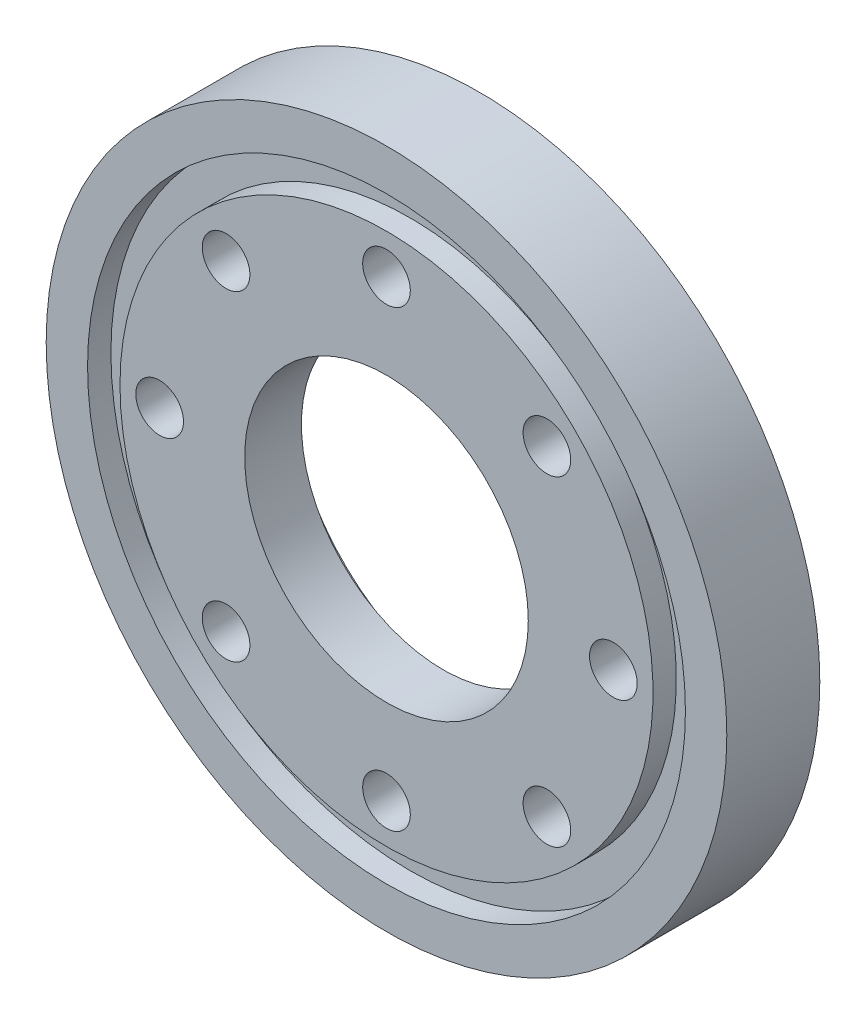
ISO-10303-21;
HEADER;
FILE_DESCRIPTION(('STEP AP214'),'2;1');
FILE_NAME('part.step','',(''),(''),'','','');
FILE_SCHEMA(('AUTOMOTIVE_DESIGN { 1 0 10303 214 1 1 1 1 }'));
ENDSEC;
DATA;
#1=APPLICATION_CONTEXT('core data for automotive mechanical design processes');
#2=APPLICATION_PROTOCOL_DEFINITION('international standard','automotive_design',2000,#1);
#3=PRODUCT_CONTEXT('',#1,'mechanical');
#4=PRODUCT('Part','Part','',(#3));
#5=PRODUCT_RELATED_PRODUCT_CATEGORY('part','',(#4));
#6=PRODUCT_DEFINITION_FORMATION('','',#4);
#7=PRODUCT_DEFINITION_CONTEXT('part definition',#1,'design');
#8=PRODUCT_DEFINITION('design','',#6,#7);
#9=PRODUCT_DEFINITION_SHAPE('','',#8);
#10=(LENGTH_UNIT() NAMED_UNIT(*) SI_UNIT(.MILLI.,.METRE.));
#11=(NAMED_UNIT(*) PLANE_ANGLE_UNIT() SI_UNIT($,.RADIAN.));
#12=(NAMED_UNIT(*) SI_UNIT($,.STERADIAN.) SOLID_ANGLE_UNIT());
#13=UNCERTAINTY_MEASURE_WITH_UNIT(LENGTH_MEASURE(1.E-05),#10,'distance_accuracy_value','');
#14=(GEOMETRIC_REPRESENTATION_CONTEXT(3) GLOBAL_UNCERTAINTY_ASSIGNED_CONTEXT((#13)) GLOBAL_UNIT_ASSIGNED_CONTEXT((#10,
#11,#12)) REPRESENTATION_CONTEXT('',''));
#15=CARTESIAN_POINT('',(0.,0.,0.));
#16=DIRECTION('',(0.,0.,1.));
#17=DIRECTION('',(1.,0.,0.));
#18=AXIS2_PLACEMENT_3D('',#15,#16,#17);
#19=CARTESIAN_POINT('',(0.,2.22044604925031E-13,-11.9850122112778));
#20=DIRECTION('',(0.,0.,-1.));
#21=DIRECTION('',(-1.,0.,0.));
#22=AXIS2_PLACEMENT_3D('',#19,#20,#21);
#23=CYLINDRICAL_SURFACE('',#22,15.0375);
#24=CARTESIAN_POINT('',(0.,0.,3.20000000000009));
#25=DIRECTION('',(0.,0.,-1.));
#26=DIRECTION('',(-1.,0.,0.));
#27=AXIS2_PLACEMENT_3D('',#24,#25,#26);
#28=CIRCLE('',#27,15.0375);
#29=CARTESIAN_POINT('',(-15.0375,0.,3.20000000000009));
#30=VERTEX_POINT('',#29);
#31=EDGE_CURVE('E148',#30,#30,#28,.T.);
#32=ORIENTED_EDGE('',*,*,#31,.F.);
#33=EDGE_LOOP('',(#32));
#34=FACE_BOUND('',#33,.T.);
#35=CARTESIAN_POINT('',(0.,0.,0.));
#36=DIRECTION('',(0.,0.,-1.));
#37=DIRECTION('',(-1.,0.,0.));
#38=AXIS2_PLACEMENT_3D('',#35,#36,#37);
#39=CIRCLE('',#38,15.0375);
#40=CARTESIAN_POINT('',(-15.0375,0.,0.));
#41=VERTEX_POINT('',#40);
#42=EDGE_CURVE('E144',#41,#41,#39,.T.);
#43=ORIENTED_EDGE('',*,*,#42,.T.);
#44=EDGE_LOOP('',(#43));
#45=FACE_BOUND('',#44,.T.);
#46=ADVANCED_FACE('F44',(#34,#45),#23,.F.);
#47=CARTESIAN_POINT('',(0.,0.,0.));
#48=DIRECTION('',(0.,0.,1.));
#49=DIRECTION('',(1.,0.,0.));
#50=AXIS2_PLACEMENT_3D('',#47,#48,#49);
#51=PLANE('',#50);
#52=CARTESIAN_POINT('',(0.,0.,0.));
#53=DIRECTION('',(0.,0.,1.));
#54=DIRECTION('',(1.,0.,0.));
#55=AXIS2_PLACEMENT_3D('',#52,#53,#54);
#56=CIRCLE('',#55,13.325);
#57=CARTESIAN_POINT('',(13.325,0.,0.));
#58=VERTEX_POINT('',#57);
#59=EDGE_CURVE('E154',#58,#58,#56,.F.);
#60=ORIENTED_EDGE('',*,*,#59,.T.);
#61=EDGE_LOOP('',(#60));
#62=FACE_BOUND('',#61,.T.);
#63=CARTESIAN_POINT('',(0.,0.,0.));
#64=DIRECTION('',(0.,0.,1.));
#65=DIRECTION('',(1.,0.,0.));
#66=AXIS2_PLACEMENT_3D('',#63,#64,#65);
#67=CIRCLE('',#66,12.5);
#68=CARTESIAN_POINT('',(12.5,0.,0.));
#69=VERTEX_POINT('',#68);
#70=EDGE_CURVE('E165',#69,#69,#67,.T.);
#71=ORIENTED_EDGE('',*,*,#70,.T.);
#72=EDGE_LOOP('',(#71));
#73=FACE_BOUND('',#72,.T.);
#74=ADVANCED_FACE('F197',(#62,#73),#51,.F.);
#75=CARTESIAN_POINT('',(0.,0.,4.99999999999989));
#76=DIRECTION('',(0.,0.,1.));
#77=DIRECTION('',(1.,0.,0.));
#78=AXIS2_PLACEMENT_3D('',#75,#76,#77);
#79=PLANE('',#78);
#80=CARTESIAN_POINT('',(0.,0.,4.99999999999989));
#81=DIRECTION('',(0.,0.,1.));
#82=DIRECTION('',(1.,0.,0.));
#83=AXIS2_PLACEMENT_3D('',#80,#81,#82);
#84=CIRCLE('',#83,30.);
#85=CARTESIAN_POINT('',(29.9999999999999,0.,4.99999999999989));
#86=VERTEX_POINT('',#85);
#87=EDGE_CURVE('E11',#86,#86,#84,.T.);
#88=ORIENTED_EDGE('',*,*,#87,.T.);
#89=EDGE_LOOP('',(#88));
#90=FACE_BOUND('',#89,.T.);
#91=CARTESIAN_POINT('',(0.,0.,4.99999999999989));
#92=DIRECTION('',(0.,0.,-1.));
#93=DIRECTION('',(-1.,0.,0.));
#94=AXIS2_PLACEMENT_3D('',#91,#92,#93);
#95=CIRCLE('',#94,26.3525);
#96=CARTESIAN_POINT('',(-26.3525000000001,0.,4.99999999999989));
#97=VERTEX_POINT('',#96);
#98=EDGE_CURVE('E158',#97,#97,#95,.T.);
#99=ORIENTED_EDGE('',*,*,#98,.T.);
#100=EDGE_LOOP('',(#99));
#101=FACE_BOUND('',#100,.T.);
#102=ADVANCED_FACE('F203',(#90,#101),#79,.T.);
#103=CARTESIAN_POINT('',(-14.1421356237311,-14.1421356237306,5.));
#104=DIRECTION('',(0.,0.,1.));
#105=DIRECTION('',(0.707106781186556,0.707106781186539,0.));
#106=AXIS2_PLACEMENT_3D('',#103,#104,#105);
#107=CIRCLE('',#106,2.09999999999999);
#108=CARTESIAN_POINT('',(-12.6572113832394,-12.6572113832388,5.));
#109=VERTEX_POINT('',#108);
#110=EDGE_CURVE('E91',#109,#109,#107,.T.);
#111=ORIENTED_EDGE('',*,*,#110,.F.);
#112=EDGE_LOOP('',(#111));
#113=FACE_BOUND('',#112,.T.);
#114=CARTESIAN_POINT('',(-2.77555756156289E-13,-20.,5.00000000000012));
#115=DIRECTION('',(0.,0.,1.));
#116=DIRECTION('',(0.,1.,0.));
#117=AXIS2_PLACEMENT_3D('',#114,#115,#116);
#118=CIRCLE('',#117,2.09999999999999);
#119=CARTESIAN_POINT('',(-2.55581666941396E-13,-17.9,5.00000000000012));
#120=VERTEX_POINT('',#119);
#121=EDGE_CURVE('E90',#120,#120,#118,.T.);
#122=ORIENTED_EDGE('',*,*,#121,.F.);
#123=EDGE_LOOP('',(#122));
#124=FACE_BOUND('',#123,.T.);
#125=CARTESIAN_POINT('',(14.1421356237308,-14.142135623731,5.00000000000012));
#126=DIRECTION('',(0.,0.,1.));
#127=DIRECTION('',(-0.707106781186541,0.707106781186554,0.));
#128=AXIS2_PLACEMENT_3D('',#125,#126,#127);
#129=CIRCLE('',#128,2.09999999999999);
#130=CARTESIAN_POINT('',(12.6572113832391,-12.6572113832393,5.00000000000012));
#131=VERTEX_POINT('',#130);
#132=EDGE_CURVE('E102',#131,#131,#129,.T.);
#133=ORIENTED_EDGE('',*,*,#132,.F.);
#134=EDGE_LOOP('',(#133));
#135=FACE_BOUND('',#134,.T.);
#136=CARTESIAN_POINT('',(20.,2.22044604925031E-13,5.00000000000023));
#137=DIRECTION('',(0.,0.,1.));
#138=DIRECTION('',(-1.,0.,0.));
#139=AXIS2_PLACEMENT_3D('',#136,#137,#138);
#140=CIRCLE('',#139,2.09999999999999);
#141=CARTESIAN_POINT('',(17.9,2.22044604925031E-13,5.00000000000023));
#142=VERTEX_POINT('',#141);
#143=EDGE_CURVE('E108',#142,#142,#140,.T.);
#144=ORIENTED_EDGE('',*,*,#143,.F.);
#145=EDGE_LOOP('',(#144));
#146=FACE_BOUND('',#145,.T.);
#147=CARTESIAN_POINT('',(14.142135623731,14.142135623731,5.00000000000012));
#148=DIRECTION('',(0.,0.,1.));
#149=DIRECTION('',(-0.707106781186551,-0.707106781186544,0.));
#150=AXIS2_PLACEMENT_3D('',#147,#148,#149);
#151=CIRCLE('',#150,2.09999999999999);
#152=CARTESIAN_POINT('',(12.6572113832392,12.6572113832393,5.00000000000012));
#153=VERTEX_POINT('',#152);
#154=EDGE_CURVE('E114',#153,#153,#151,.T.);
#155=ORIENTED_EDGE('',*,*,#154,.F.);
#156=EDGE_LOOP('',(#155));
#157=FACE_BOUND('',#156,.T.);
#158=CARTESIAN_POINT('',(0.,20.,5.00000000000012));
#159=DIRECTION('',(0.,0.,1.));
#160=DIRECTION('',(0.,-1.,0.));
#161=AXIS2_PLACEMENT_3D('',#158,#159,#160);
#162=CIRCLE('',#161,2.09999999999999);
#163=CARTESIAN_POINT('',(0.,17.9,5.00000000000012));
#164=VERTEX_POINT('',#163);
#165=EDGE_CURVE('E120',#164,#164,#162,.T.);
#166=ORIENTED_EDGE('',*,*,#165,.F.);
#167=EDGE_LOOP('',(#166));
#168=FACE_BOUND('',#167,.T.);
#169=CARTESIAN_POINT('',(-14.142135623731,14.142135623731,5.00000000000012));
#170=DIRECTION('',(0.,0.,1.));
#171=DIRECTION('',(0.707106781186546,-0.707106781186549,0.));
#172=AXIS2_PLACEMENT_3D('',#169,#170,#171);
#173=CIRCLE('',#172,2.09999999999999);
#174=CARTESIAN_POINT('',(-12.6572113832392,12.6572113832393,5.00000000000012));
#175=VERTEX_POINT('',#174);
#176=EDGE_CURVE('E126',#175,#175,#173,.T.);
#177=ORIENTED_EDGE('',*,*,#176,.F.);
#178=EDGE_LOOP('',(#177));
#179=FACE_BOUND('',#178,.T.);
#180=CARTESIAN_POINT('',(-20.0000000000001,2.22044604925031E-13,5.00000000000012));
#181=DIRECTION('',(0.,0.,1.));
#182=DIRECTION('',(1.,0.,0.));
#183=AXIS2_PLACEMENT_3D('',#180,#181,#182);
#184=CIRCLE('',#183,2.09999999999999);
#185=CARTESIAN_POINT('',(-17.9000000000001,2.22044604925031E-13,5.00000000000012));
#186=VERTEX_POINT('',#185);
#187=EDGE_CURVE('E132',#186,#186,#184,.T.);
#188=ORIENTED_EDGE('',*,*,#187,.F.);
#189=EDGE_LOOP('',(#188));
#190=FACE_BOUND('',#189,.T.);
#191=CARTESIAN_POINT('',(0.,0.,4.99999999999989));
#192=DIRECTION('',(0.,0.,-1.));
#193=DIRECTION('',(-1.,0.,0.));
#194=AXIS2_PLACEMENT_3D('',#191,#192,#193);
#195=CIRCLE('',#194,23.495);
#196=CARTESIAN_POINT('',(-23.4950000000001,0.,4.99999999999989));
#197=VERTEX_POINT('',#196);
#198=EDGE_CURVE('E159',#197,#197,#195,.T.);
#199=ORIENTED_EDGE('',*,*,#198,.F.);
#200=EDGE_LOOP('',(#199));
#201=FACE_BOUND('',#200,.T.);
#202=CARTESIAN_POINT('',(0.,0.,4.99999999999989));
#203=DIRECTION('',(0.,0.,1.));
#204=DIRECTION('',(1.,0.,0.));
#205=AXIS2_PLACEMENT_3D('',#202,#203,#204);
#206=CIRCLE('',#205,12.5);
#207=CARTESIAN_POINT('',(12.4999999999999,0.,4.99999999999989));
#208=VERTEX_POINT('',#207);
#209=EDGE_CURVE('E53',#208,#208,#206,.T.);
#210=ORIENTED_EDGE('',*,*,#209,.F.);
#211=EDGE_LOOP('',(#210));
#212=FACE_BOUND('',#211,.T.);
#213=ADVANCED_FACE('F233',(#113,#124,#135,#146,#157,#168,#179,#190,#201,#212),#79,.T.);
#214=CARTESIAN_POINT('',(0.,0.,4.99999999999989));
#215=DIRECTION('',(0.,0.,-1.));
#216=DIRECTION('',(-1.,0.,0.));
#217=AXIS2_PLACEMENT_3D('',#214,#215,#216);
#218=CYLINDRICAL_SURFACE('',#217,30.);
#219=ORIENTED_EDGE('',*,*,#87,.F.);
#220=EDGE_LOOP('',(#219));
#221=FACE_BOUND('',#220,.T.);
#222=CARTESIAN_POINT('',(0.,0.,-3.19999999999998));
#223=DIRECTION('',(0.,0.,-1.));
#224=DIRECTION('',(-1.,0.,0.));
#225=AXIS2_PLACEMENT_3D('',#222,#223,#224);
#226=CIRCLE('',#225,30.);
#227=CARTESIAN_POINT('',(-30.0000000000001,0.,-3.19999999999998));
#228=VERTEX_POINT('',#227);
#229=EDGE_CURVE('E141',#228,#228,#226,.T.);
#230=ORIENTED_EDGE('',*,*,#229,.F.);
#231=EDGE_LOOP('',(#230));
#232=FACE_BOUND('',#231,.T.);
#233=ADVANCED_FACE('F46',(#221,#232),#218,.T.);
#234=CARTESIAN_POINT('',(0.,0.,4.99999999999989));
#235=DIRECTION('',(0.,0.,-1.));
#236=DIRECTION('',(-1.,0.,0.));
#237=AXIS2_PLACEMENT_3D('',#234,#235,#236);
#238=CYLINDRICAL_SURFACE('',#237,12.5);
#239=ORIENTED_EDGE('',*,*,#209,.T.);
#240=EDGE_LOOP('',(#239));
#241=FACE_BOUND('',#240,.T.);
#242=ORIENTED_EDGE('',*,*,#70,.F.);
#243=EDGE_LOOP('',(#242));
#244=FACE_BOUND('',#243,.T.);
#245=ADVANCED_FACE('F225',(#241,#244),#238,.F.);
#246=CARTESIAN_POINT('',(0.,0.,2.94260000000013));
#247=DIRECTION('',(0.,0.,-1.));
#248=DIRECTION('',(-1.,0.,0.));
#249=AXIS2_PLACEMENT_3D('',#246,#247,#248);
#250=PLANE('',#249);
#251=CARTESIAN_POINT('',(0.,0.,2.94260000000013));
#252=DIRECTION('',(0.,0.,-1.));
#253=DIRECTION('',(-1.,0.,0.));
#254=AXIS2_PLACEMENT_3D('',#251,#252,#253);
#255=CIRCLE('',#254,26.3525);
#256=CARTESIAN_POINT('',(-26.3525,0.,2.94260000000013));
#257=VERTEX_POINT('',#256);
#258=EDGE_CURVE('E162',#257,#257,#255,.T.);
#259=ORIENTED_EDGE('',*,*,#258,.F.);
#260=EDGE_LOOP('',(#259));
#261=FACE_BOUND('',#260,.T.);
#262=CARTESIAN_POINT('',(0.,0.,2.94260000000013));
#263=DIRECTION('',(0.,0.,-1.));
#264=DIRECTION('',(-1.,0.,0.));
#265=AXIS2_PLACEMENT_3D('',#262,#263,#264);
#266=CIRCLE('',#265,23.495);
#267=CARTESIAN_POINT('',(-23.495,0.,2.94260000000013));
#268=VERTEX_POINT('',#267);
#269=EDGE_CURVE('E155',#268,#268,#266,.T.);
#270=ORIENTED_EDGE('',*,*,#269,.T.);
#271=EDGE_LOOP('',(#270));
#272=FACE_BOUND('',#271,.T.);
#273=ADVANCED_FACE('F222',(#261,#272),#250,.F.);
#274=CARTESIAN_POINT('',(0.,0.,2.94260000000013));
#275=DIRECTION('',(0.,0.,1.));
#276=DIRECTION('',(1.,0.,0.));
#277=AXIS2_PLACEMENT_3D('',#274,#275,#276);
#278=CYLINDRICAL_SURFACE('',#277,26.3525);
#279=ORIENTED_EDGE('',*,*,#258,.T.);
#280=EDGE_LOOP('',(#279));
#281=FACE_BOUND('',#280,.T.);
#282=ORIENTED_EDGE('',*,*,#98,.F.);
#283=EDGE_LOOP('',(#282));
#284=FACE_BOUND('',#283,.T.);
#285=ADVANCED_FACE('F220',(#281,#284),#278,.F.);
#286=CARTESIAN_POINT('',(0.,0.,2.94260000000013));
#287=DIRECTION('',(0.,0.,1.));
#288=DIRECTION('',(1.,0.,0.));
#289=AXIS2_PLACEMENT_3D('',#286,#287,#288);
#290=CYLINDRICAL_SURFACE('',#289,23.495);
#291=ORIENTED_EDGE('',*,*,#269,.F.);
#292=EDGE_LOOP('',(#291));
#293=FACE_BOUND('',#292,.T.);
#294=ORIENTED_EDGE('',*,*,#198,.T.);
#295=EDGE_LOOP('',(#294));
#296=FACE_BOUND('',#295,.T.);
#297=ADVANCED_FACE('F216',(#293,#296),#290,.T.);
#298=CARTESIAN_POINT('',(0.,0.,1.79999999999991));
#299=DIRECTION('',(0.,0.,-1.));
#300=DIRECTION('',(-1.,0.,0.));
#301=AXIS2_PLACEMENT_3D('',#298,#299,#300);
#302=CONICAL_SURFACE('',#301,12.6875,0.340381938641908);
#303=CARTESIAN_POINT('',(0.,0.,-0.599999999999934));
#304=DIRECTION('',(0.,0.,-1.));
#305=DIRECTION('',(-1.,0.,0.));
#306=AXIS2_PLACEMENT_3D('',#303,#304,#305);
#307=CIRCLE('',#306,13.5375);
#308=CARTESIAN_POINT('',(-13.5375000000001,0.,-0.599999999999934));
#309=VERTEX_POINT('',#308);
#310=EDGE_CURVE('E151',#309,#309,#307,.T.);
#311=ORIENTED_EDGE('',*,*,#310,.T.);
#312=EDGE_LOOP('',(#311));
#313=FACE_BOUND('',#312,.T.);
#314=ORIENTED_EDGE('',*,*,#59,.F.);
#315=EDGE_LOOP('',(#314));
#316=FACE_BOUND('',#315,.T.);
#317=ADVANCED_FACE('F212',(#313,#316),#302,.F.);
#318=CARTESIAN_POINT('',(0.,2.22044604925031E-13,-11.9850122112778));
#319=DIRECTION('',(0.,0.,-1.));
#320=DIRECTION('',(-1.,0.,0.));
#321=AXIS2_PLACEMENT_3D('',#318,#319,#320);
#322=CYLINDRICAL_SURFACE('',#321,13.5375);
#323=ORIENTED_EDGE('',*,*,#310,.F.);
#324=EDGE_LOOP('',(#323));
#325=FACE_BOUND('',#324,.T.);
#326=CARTESIAN_POINT('',(0.,0.,3.20000000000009));
#327=DIRECTION('',(0.,0.,-1.));
#328=DIRECTION('',(-1.,0.,0.));
#329=AXIS2_PLACEMENT_3D('',#326,#327,#328);
#330=CIRCLE('',#329,13.5375);
#331=CARTESIAN_POINT('',(-13.5375,0.,3.20000000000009));
#332=VERTEX_POINT('',#331);
#333=EDGE_CURVE('E145',#332,#332,#330,.T.);
#334=ORIENTED_EDGE('',*,*,#333,.T.);
#335=EDGE_LOOP('',(#334));
#336=FACE_BOUND('',#335,.T.);
#337=ADVANCED_FACE('F209',(#325,#336),#322,.T.);
#338=CARTESIAN_POINT('',(0.,0.,3.20000000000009));
#339=DIRECTION('',(0.,0.,-1.));
#340=DIRECTION('',(-1.,0.,0.));
#341=AXIS2_PLACEMENT_3D('',#338,#339,#340);
#342=PLANE('',#341);
#343=ORIENTED_EDGE('',*,*,#333,.F.);
#344=EDGE_LOOP('',(#343));
#345=FACE_BOUND('',#344,.T.);
#346=ORIENTED_EDGE('',*,*,#31,.T.);
#347=EDGE_LOOP('',(#346));
#348=FACE_BOUND('',#347,.T.);
#349=ADVANCED_FACE('F208',(#345,#348),#342,.T.);
#350=CARTESIAN_POINT('',(0.,0.,-3.19999999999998));
#351=DIRECTION('',(0.,0.,-1.));
#352=DIRECTION('',(-1.,0.,0.));
#353=AXIS2_PLACEMENT_3D('',#350,#351,#352);
#354=PLANE('',#353);
#355=CARTESIAN_POINT('',(0.,0.,-3.19999999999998));
#356=DIRECTION('',(0.,0.,1.));
#357=DIRECTION('',(1.,0.,0.));
#358=AXIS2_PLACEMENT_3D('',#355,#356,#357);
#359=CIRCLE('',#358,16.891);
#360=CARTESIAN_POINT('',(16.8909999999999,0.,-3.19999999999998));
#361=VERTEX_POINT('',#360);
#362=EDGE_CURVE('E336',#361,#361,#359,.T.);
#363=ORIENTED_EDGE('',*,*,#362,.T.);
#364=EDGE_LOOP('',(#363));
#365=FACE_BOUND('',#364,.T.);
#366=ORIENTED_EDGE('',*,*,#229,.T.);
#367=EDGE_LOOP('',(#366));
#368=FACE_BOUND('',#367,.T.);
#369=ADVANCED_FACE('F181',(#365,#368),#354,.T.);
#370=CARTESIAN_POINT('',(0.,0.,0.));
#371=DIRECTION('',(0.,0.,-1.));
#372=DIRECTION('',(-1.,0.,0.));
#373=AXIS2_PLACEMENT_3D('',#370,#371,#372);
#374=PLANE('',#373);
#375=ORIENTED_EDGE('',*,*,#42,.F.);
#376=EDGE_LOOP('',(#375));
#377=FACE_BOUND('',#376,.T.);
#378=CARTESIAN_POINT('',(0.,0.,0.));
#379=DIRECTION('',(0.,0.,-1.));
#380=DIRECTION('',(-1.,0.,0.));
#381=AXIS2_PLACEMENT_3D('',#378,#379,#380);
#382=CIRCLE('',#381,15.);
#383=CARTESIAN_POINT('',(-15.,0.,0.));
#384=VERTEX_POINT('',#383);
#385=EDGE_CURVE('E138',#384,#384,#382,.T.);
#386=ORIENTED_EDGE('',*,*,#385,.T.);
#387=EDGE_LOOP('',(#386));
#388=FACE_BOUND('',#387,.T.);
#389=ADVANCED_FACE('F177',(#377,#388),#374,.F.);
#390=CARTESIAN_POINT('',(0.,0.,-3.19999999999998));
#391=DIRECTION('',(0.,0.,1.));
#392=DIRECTION('',(1.,0.,0.));
#393=AXIS2_PLACEMENT_3D('',#390,#391,#392);
#394=CYLINDRICAL_SURFACE('',#393,15.);
#395=CARTESIAN_POINT('',(0.,2.22044604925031E-13,-0.0250000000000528));
#396=DIRECTION('',(0.,0.,1.));
#397=DIRECTION('',(1.,0.,0.));
#398=AXIS2_PLACEMENT_3D('',#395,#396,#397);
#399=CIRCLE('',#398,15.);
#400=CARTESIAN_POINT('',(15.,2.22044604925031E-13,-0.0250000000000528));
#401=VERTEX_POINT('',#400);
#402=EDGE_CURVE('E48',#401,#401,#399,.T.);
#403=ORIENTED_EDGE('',*,*,#402,.F.);
#404=EDGE_LOOP('',(#403));
#405=FACE_BOUND('',#404,.T.);
#406=ORIENTED_EDGE('',*,*,#385,.F.);
#407=EDGE_LOOP('',(#406));
#408=FACE_BOUND('',#407,.T.);
#409=ADVANCED_FACE('F180',(#405,#408),#394,.F.);
#410=CARTESIAN_POINT('',(-20.0000000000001,0.,2.22044604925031E-13));
#411=DIRECTION('',(0.,0.,1.));
#412=DIRECTION('',(1.,0.,0.));
#413=AXIS2_PLACEMENT_3D('',#410,#411,#412);
#414=CONICAL_SURFACE('',#413,2.1,1.02974425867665);
#415=CARTESIAN_POINT('',(-20.0000000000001,0.,-1.26180729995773));
#416=VERTEX_POINT('',#415);
#417=VERTEX_LOOP('',#416);
#418=FACE_BOUND('',#417,.T.);
#419=CARTESIAN_POINT('',(-20.0000000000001,0.,2.22044604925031E-13));
#420=DIRECTION('',(0.,0.,1.));
#421=DIRECTION('',(1.,0.,0.));
#422=AXIS2_PLACEMENT_3D('',#419,#420,#421);
#423=CIRCLE('',#422,2.1);
#424=CARTESIAN_POINT('',(-17.9000000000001,0.,2.22044604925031E-13));
#425=VERTEX_POINT('',#424);
#426=EDGE_CURVE('E135',#425,#425,#423,.T.);
#427=ORIENTED_EDGE('',*,*,#426,.T.);
#428=EDGE_LOOP('',(#427));
#429=FACE_BOUND('',#428,.T.);
#430=ADVANCED_FACE('F186',(#418,#429),#414,.F.);
#431=CARTESIAN_POINT('',(-20.0000000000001,2.22044604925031E-13,5.00000000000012));
#432=DIRECTION('',(0.,0.,1.));
#433=DIRECTION('',(1.,0.,0.));
#434=AXIS2_PLACEMENT_3D('',#431,#432,#433);
#435=CYLINDRICAL_SURFACE('',#434,2.09999999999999);
#436=ORIENTED_EDGE('',*,*,#426,.F.);
#437=EDGE_LOOP('',(#436));
#438=FACE_BOUND('',#437,.T.);
#439=ORIENTED_EDGE('',*,*,#187,.T.);
#440=EDGE_LOOP('',(#439));
#441=FACE_BOUND('',#440,.T.);
#442=ADVANCED_FACE('F192',(#438,#441),#435,.F.);
#443=CARTESIAN_POINT('',(-14.142135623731,14.142135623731,0.));
#444=DIRECTION('',(0.,0.,1.));
#445=DIRECTION('',(0.707106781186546,-0.707106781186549,0.));
#446=AXIS2_PLACEMENT_3D('',#443,#444,#445);
#447=CONICAL_SURFACE('',#446,2.1,1.02974425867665);
#448=CARTESIAN_POINT('',(-14.142135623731,14.142135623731,-1.26180729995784));
#449=VERTEX_POINT('',#448);
#450=VERTEX_LOOP('',#449);
#451=FACE_BOUND('',#450,.T.);
#452=CARTESIAN_POINT('',(-14.142135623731,14.142135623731,0.));
#453=DIRECTION('',(0.,0.,1.));
#454=DIRECTION('',(0.707106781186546,-0.707106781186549,0.));
#455=AXIS2_PLACEMENT_3D('',#452,#453,#454);
#456=CIRCLE('',#455,2.1);
#457=CARTESIAN_POINT('',(-12.6572113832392,12.6572113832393,0.));
#458=VERTEX_POINT('',#457);
#459=EDGE_CURVE('E129',#458,#458,#456,.T.);
#460=ORIENTED_EDGE('',*,*,#459,.T.);
#461=EDGE_LOOP('',(#460));
#462=FACE_BOUND('',#461,.T.);
#463=ADVANCED_FACE('F267',(#451,#462),#447,.F.);
#464=CARTESIAN_POINT('',(-14.142135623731,14.142135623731,5.00000000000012));
#465=DIRECTION('',(0.,0.,1.));
#466=DIRECTION('',(0.707106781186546,-0.707106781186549,0.));
#467=AXIS2_PLACEMENT_3D('',#464,#465,#466);
#468=CYLINDRICAL_SURFACE('',#467,2.09999999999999);
#469=ORIENTED_EDGE('',*,*,#459,.F.);
#470=EDGE_LOOP('',(#469));
#471=FACE_BOUND('',#470,.T.);
#472=ORIENTED_EDGE('',*,*,#176,.T.);
#473=EDGE_LOOP('',(#472));
#474=FACE_BOUND('',#473,.T.);
#475=ADVANCED_FACE('F270',(#471,#474),#468,.F.);
#476=CARTESIAN_POINT('',(0.,20.,2.22044604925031E-13));
#477=DIRECTION('',(0.,0.,1.));
#478=DIRECTION('',(0.,-1.,0.));
#479=AXIS2_PLACEMENT_3D('',#476,#477,#478);
#480=CONICAL_SURFACE('',#479,2.1,1.02974425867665);
#481=CARTESIAN_POINT('',(0.,20.,-1.26180729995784));
#482=VERTEX_POINT('',#481);
#483=VERTEX_LOOP('',#482);
#484=FACE_BOUND('',#483,.T.);
#485=CARTESIAN_POINT('',(0.,20.,2.22044604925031E-13));
#486=DIRECTION('',(0.,0.,1.));
#487=DIRECTION('',(0.,-1.,0.));
#488=AXIS2_PLACEMENT_3D('',#485,#486,#487);
#489=CIRCLE('',#488,2.1);
#490=CARTESIAN_POINT('',(0.,17.9,2.22015461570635E-13));
#491=VERTEX_POINT('',#490);
#492=EDGE_CURVE('E123',#491,#491,#489,.T.);
#493=ORIENTED_EDGE('',*,*,#492,.T.);
#494=EDGE_LOOP('',(#493));
#495=FACE_BOUND('',#494,.T.);
#496=ADVANCED_FACE('F278',(#484,#495),#480,.F.);
#497=CARTESIAN_POINT('',(0.,20.,5.00000000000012));
#498=DIRECTION('',(0.,0.,1.));
#499=DIRECTION('',(0.,-1.,0.));
#500=AXIS2_PLACEMENT_3D('',#497,#498,#499);
#501=CYLINDRICAL_SURFACE('',#500,2.09999999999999);
#502=ORIENTED_EDGE('',*,*,#492,.F.);
#503=EDGE_LOOP('',(#502));
#504=FACE_BOUND('',#503,.T.);
#505=ORIENTED_EDGE('',*,*,#165,.T.);
#506=EDGE_LOOP('',(#505));
#507=FACE_BOUND('',#506,.T.);
#508=ADVANCED_FACE('F275',(#504,#507),#501,.F.);
#509=CARTESIAN_POINT('',(14.142135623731,14.142135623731,0.));
#510=DIRECTION('',(0.,0.,1.));
#511=DIRECTION('',(-0.707106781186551,-0.707106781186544,0.));
#512=AXIS2_PLACEMENT_3D('',#509,#510,#511);
#513=CONICAL_SURFACE('',#512,2.1,1.02974425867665);
#514=CARTESIAN_POINT('',(14.142135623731,14.142135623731,-1.26180729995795));
#515=VERTEX_POINT('',#514);
#516=VERTEX_LOOP('',#515);
#517=FACE_BOUND('',#516,.T.);
#518=CARTESIAN_POINT('',(14.142135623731,14.142135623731,0.));
#519=DIRECTION('',(0.,0.,1.));
#520=DIRECTION('',(-0.707106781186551,-0.707106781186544,0.));
#521=AXIS2_PLACEMENT_3D('',#518,#519,#520);
#522=CIRCLE('',#521,2.1);
#523=CARTESIAN_POINT('',(12.6572113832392,12.6572113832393,0.));
#524=VERTEX_POINT('',#523);
#525=EDGE_CURVE('E117',#524,#524,#522,.T.);
#526=ORIENTED_EDGE('',*,*,#525,.T.);
#527=EDGE_LOOP('',(#526));
#528=FACE_BOUND('',#527,.T.);
#529=ADVANCED_FACE('F292',(#517,#528),#513,.F.);
#530=CARTESIAN_POINT('',(14.142135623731,14.142135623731,5.00000000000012));
#531=DIRECTION('',(0.,0.,1.));
#532=DIRECTION('',(-0.707106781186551,-0.707106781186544,0.));
#533=AXIS2_PLACEMENT_3D('',#530,#531,#532);
#534=CYLINDRICAL_SURFACE('',#533,2.09999999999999);
#535=ORIENTED_EDGE('',*,*,#525,.F.);
#536=EDGE_LOOP('',(#535));
#537=FACE_BOUND('',#536,.T.);
#538=ORIENTED_EDGE('',*,*,#154,.T.);
#539=EDGE_LOOP('',(#538));
#540=FACE_BOUND('',#539,.T.);
#541=ADVANCED_FACE('F286',(#537,#540),#534,.F.);
#542=CARTESIAN_POINT('',(20.,2.22044604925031E-13,1.11022302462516E-13));
#543=DIRECTION('',(0.,0.,1.));
#544=DIRECTION('',(-1.,0.,0.));
#545=AXIS2_PLACEMENT_3D('',#542,#543,#544);
#546=CONICAL_SURFACE('',#545,2.1,1.02974425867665);
#547=CARTESIAN_POINT('',(20.,0.,-1.26180729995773));
#548=VERTEX_POINT('',#547);
#549=VERTEX_LOOP('',#548);
#550=FACE_BOUND('',#549,.T.);
#551=CARTESIAN_POINT('',(20.,2.22044604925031E-13,1.11022302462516E-13));
#552=DIRECTION('',(0.,0.,1.));
#553=DIRECTION('',(-1.,0.,0.));
#554=AXIS2_PLACEMENT_3D('',#551,#552,#553);
#555=CIRCLE('',#554,2.1);
#556=CARTESIAN_POINT('',(17.9,2.22044604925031E-13,1.11022302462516E-13));
#557=VERTEX_POINT('',#556);
#558=EDGE_CURVE('E111',#557,#557,#555,.T.);
#559=ORIENTED_EDGE('',*,*,#558,.T.);
#560=EDGE_LOOP('',(#559));
#561=FACE_BOUND('',#560,.T.);
#562=ADVANCED_FACE('F300',(#550,#561),#546,.F.);
#563=CARTESIAN_POINT('',(20.,2.22044604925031E-13,5.00000000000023));
#564=DIRECTION('',(0.,0.,1.));
#565=DIRECTION('',(-1.,0.,0.));
#566=AXIS2_PLACEMENT_3D('',#563,#564,#565);
#567=CYLINDRICAL_SURFACE('',#566,2.09999999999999);
#568=ORIENTED_EDGE('',*,*,#558,.F.);
#569=EDGE_LOOP('',(#568));
#570=FACE_BOUND('',#569,.T.);
#571=ORIENTED_EDGE('',*,*,#143,.T.);
#572=EDGE_LOOP('',(#571));
#573=FACE_BOUND('',#572,.T.);
#574=ADVANCED_FACE('F297',(#570,#573),#567,.F.);
#575=CARTESIAN_POINT('',(14.1421356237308,-14.142135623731,0.));
#576=DIRECTION('',(0.,0.,1.));
#577=DIRECTION('',(-0.707106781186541,0.707106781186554,0.));
#578=AXIS2_PLACEMENT_3D('',#575,#576,#577);
#579=CONICAL_SURFACE('',#578,2.1,1.02974425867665);
#580=CARTESIAN_POINT('',(14.1421356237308,-14.142135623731,-1.26180729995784));
#581=VERTEX_POINT('',#580);
#582=VERTEX_LOOP('',#581);
#583=FACE_BOUND('',#582,.T.);
#584=CARTESIAN_POINT('',(14.1421356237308,-14.142135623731,0.));
#585=DIRECTION('',(0.,0.,1.));
#586=DIRECTION('',(-0.707106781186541,0.707106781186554,0.));
#587=AXIS2_PLACEMENT_3D('',#584,#585,#586);
#588=CIRCLE('',#587,2.1);
#589=CARTESIAN_POINT('',(12.657211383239,-12.6572113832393,0.));
#590=VERTEX_POINT('',#589);
#591=EDGE_CURVE('E105',#590,#590,#588,.T.);
#592=ORIENTED_EDGE('',*,*,#591,.T.);
#593=EDGE_LOOP('',(#592));
#594=FACE_BOUND('',#593,.T.);
#595=ADVANCED_FACE('F308',(#583,#594),#579,.F.);
#596=CARTESIAN_POINT('',(14.1421356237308,-14.142135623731,5.00000000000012));
#597=DIRECTION('',(0.,0.,1.));
#598=DIRECTION('',(-0.707106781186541,0.707106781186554,0.));
#599=AXIS2_PLACEMENT_3D('',#596,#597,#598);
#600=CYLINDRICAL_SURFACE('',#599,2.09999999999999);
#601=ORIENTED_EDGE('',*,*,#591,.F.);
#602=EDGE_LOOP('',(#601));
#603=FACE_BOUND('',#602,.T.);
#604=ORIENTED_EDGE('',*,*,#132,.T.);
#605=EDGE_LOOP('',(#604));
#606=FACE_BOUND('',#605,.T.);
#607=ADVANCED_FACE('F305',(#603,#606),#600,.F.);
#608=CARTESIAN_POINT('',(-2.77555756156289E-13,-19.9999999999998,0.));
#609=DIRECTION('',(0.,0.,1.));
#610=DIRECTION('',(0.,1.,0.));
#611=AXIS2_PLACEMENT_3D('',#608,#609,#610);
#612=CONICAL_SURFACE('',#611,2.1,1.02974425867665);
#613=CARTESIAN_POINT('',(-2.77555756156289E-13,-19.9999999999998,-1.26180729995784));
#614=VERTEX_POINT('',#613);
#615=VERTEX_LOOP('',#614);
#616=FACE_BOUND('',#615,.T.);
#617=CARTESIAN_POINT('',(-2.77555756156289E-13,-19.9999999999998,0.));
#618=DIRECTION('',(0.,0.,1.));
#619=DIRECTION('',(0.,1.,0.));
#620=AXIS2_PLACEMENT_3D('',#617,#618,#619);
#621=CIRCLE('',#620,2.1);
#622=CARTESIAN_POINT('',(-2.55581666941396E-13,-17.8999999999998,0.));
#623=VERTEX_POINT('',#622);
#624=EDGE_CURVE('E94',#623,#623,#621,.T.);
#625=ORIENTED_EDGE('',*,*,#624,.T.);
#626=EDGE_LOOP('',(#625));
#627=FACE_BOUND('',#626,.T.);
#628=ADVANCED_FACE('F315',(#616,#627),#612,.F.);
#629=CARTESIAN_POINT('',(-2.77555756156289E-13,-20.,5.00000000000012));
#630=DIRECTION('',(0.,0.,1.));
#631=DIRECTION('',(0.,1.,0.));
#632=AXIS2_PLACEMENT_3D('',#629,#630,#631);
#633=CYLINDRICAL_SURFACE('',#632,2.09999999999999);
#634=ORIENTED_EDGE('',*,*,#624,.F.);
#635=EDGE_LOOP('',(#634));
#636=FACE_BOUND('',#635,.T.);
#637=ORIENTED_EDGE('',*,*,#121,.T.);
#638=EDGE_LOOP('',(#637));
#639=FACE_BOUND('',#638,.T.);
#640=ADVANCED_FACE('F83',(#636,#639),#633,.F.);
#641=CARTESIAN_POINT('',(-14.1421356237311,-14.1421356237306,0.));
#642=DIRECTION('',(0.,0.,1.));
#643=DIRECTION('',(0.707106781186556,0.707106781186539,0.));
#644=AXIS2_PLACEMENT_3D('',#641,#642,#643);
#645=CONICAL_SURFACE('',#644,2.1,1.02974425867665);
#646=CARTESIAN_POINT('',(-14.1421356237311,-14.1421356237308,-1.26180729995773));
#647=VERTEX_POINT('',#646);
#648=VERTEX_LOOP('',#647);
#649=FACE_BOUND('',#648,.T.);
#650=CARTESIAN_POINT('',(-14.1421356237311,-14.1421356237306,0.));
#651=DIRECTION('',(0.,0.,1.));
#652=DIRECTION('',(0.707106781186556,0.707106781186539,0.));
#653=AXIS2_PLACEMENT_3D('',#650,#651,#652);
#654=CIRCLE('',#653,2.1);
#655=CARTESIAN_POINT('',(-12.6572113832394,-12.6572113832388,0.));
#656=VERTEX_POINT('',#655);
#657=EDGE_CURVE('E88',#656,#656,#654,.T.);
#658=ORIENTED_EDGE('',*,*,#657,.T.);
#659=EDGE_LOOP('',(#658));
#660=FACE_BOUND('',#659,.T.);
#661=ADVANCED_FACE('F79',(#649,#660),#645,.F.);
#662=CARTESIAN_POINT('',(-14.1421356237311,-14.1421356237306,5.));
#663=DIRECTION('',(0.,0.,1.));
#664=DIRECTION('',(0.707106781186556,0.707106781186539,0.));
#665=AXIS2_PLACEMENT_3D('',#662,#663,#664);
#666=CYLINDRICAL_SURFACE('',#665,2.09999999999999);
#667=ORIENTED_EDGE('',*,*,#657,.F.);
#668=EDGE_LOOP('',(#667));
#669=FACE_BOUND('',#668,.T.);
#670=ORIENTED_EDGE('',*,*,#110,.T.);
#671=EDGE_LOOP('',(#670));
#672=FACE_BOUND('',#671,.T.);
#673=ADVANCED_FACE('F82',(#669,#672),#666,.F.);
#674=CARTESIAN_POINT('',(14.9859999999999,0.,-0.0249999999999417));
#675=DIRECTION('',(0.,0.,1.));
#676=DIRECTION('',(1.,0.,0.));
#677=AXIS2_PLACEMENT_3D('',#674,#675,#676);
#678=PLANE('',#677);
#679=ORIENTED_EDGE('',*,*,#402,.T.);
#680=EDGE_LOOP('',(#679));
#681=FACE_BOUND('',#680,.T.);
#682=CARTESIAN_POINT('',(0.,2.22044604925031E-13,-0.0250000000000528));
#683=DIRECTION('',(0.,0.,1.));
#684=DIRECTION('',(1.,0.,0.));
#685=AXIS2_PLACEMENT_3D('',#682,#683,#684);
#686=CIRCLE('',#685,16.891);
#687=CARTESIAN_POINT('',(16.891,2.22044604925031E-13,-0.0250000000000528));
#688=VERTEX_POINT('',#687);
#689=EDGE_CURVE('E339',#688,#688,#686,.T.);
#690=ORIENTED_EDGE('',*,*,#689,.F.);
#691=EDGE_LOOP('',(#690));
#692=FACE_BOUND('',#691,.T.);
#693=ADVANCED_FACE('F85',(#681,#692),#678,.F.);
#694=CARTESIAN_POINT('',(0.,0.,4.99999999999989));
#695=DIRECTION('',(0.,0.,1.));
#696=DIRECTION('',(1.,0.,0.));
#697=AXIS2_PLACEMENT_3D('',#694,#695,#696);
#698=CYLINDRICAL_SURFACE('',#697,16.891);
#699=ORIENTED_EDGE('',*,*,#362,.F.);
#700=EDGE_LOOP('',(#699));
#701=FACE_BOUND('',#700,.T.);
#702=ORIENTED_EDGE('',*,*,#689,.T.);
#703=EDGE_LOOP('',(#702));
#704=FACE_BOUND('',#703,.T.);
#705=ADVANCED_FACE('F327',(#701,#704),#698,.F.);
#706=CLOSED_SHELL('',(#46,#74,#102,#213,#233,#245,#273,#285,#297,#317,#337,#349,#369,#389,#409,
#430,#442,#463,#475,#496,#508,#529,#541,#562,#574,#595,#607,#628,#640,#661,#673,#693,#705));
#707=MANIFOLD_SOLID_BREP('B2',#706);
#708=ADVANCED_BREP_SHAPE_REPRESENTATION('',(#18,#707),#14);
#709=SHAPE_DEFINITION_REPRESENTATION(#9,#708);
ENDSEC;
END-ISO-10303-21;
